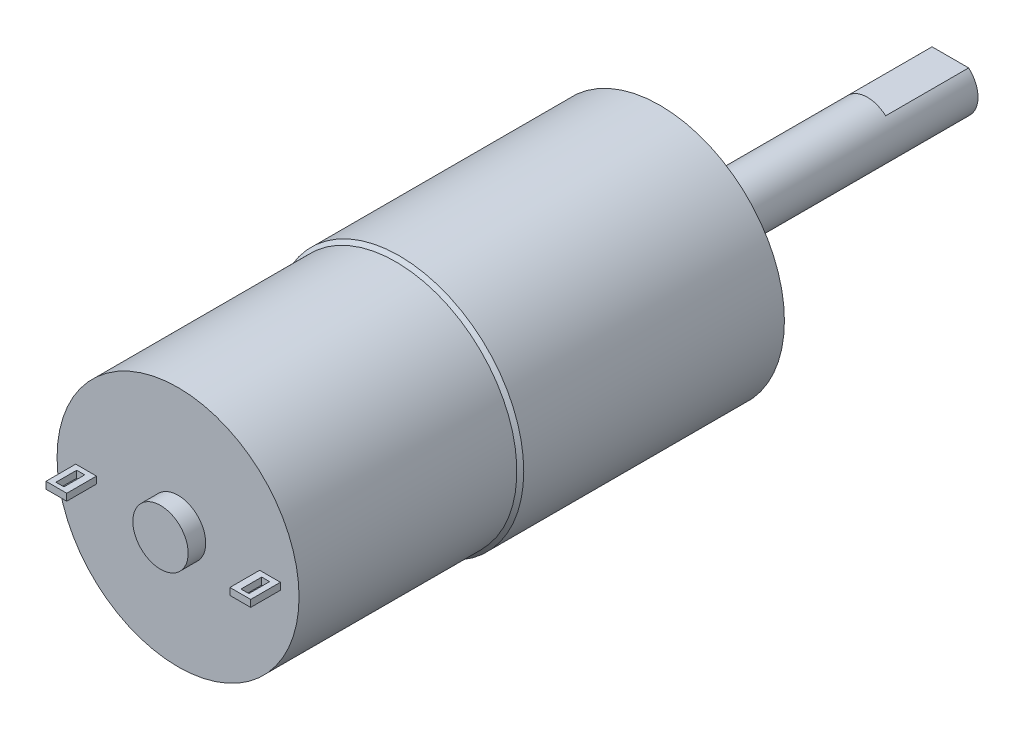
ISO-10303-21;
HEADER;
FILE_DESCRIPTION(('STEP AP214'),'2;1');
FILE_NAME('part.step','',(''),(''),'','','');
FILE_SCHEMA(('AUTOMOTIVE_DESIGN { 1 0 10303 214 1 1 1 1 }'));
ENDSEC;
DATA;
#1=APPLICATION_CONTEXT('core data for automotive mechanical design processes');
#2=APPLICATION_PROTOCOL_DEFINITION('international standard','automotive_design',2000,#1);
#3=PRODUCT_CONTEXT('',#1,'mechanical');
#4=PRODUCT('Part','Part','',(#3));
#5=PRODUCT_RELATED_PRODUCT_CATEGORY('part','',(#4));
#6=PRODUCT_DEFINITION_FORMATION('','',#4);
#7=PRODUCT_DEFINITION_CONTEXT('part definition',#1,'design');
#8=PRODUCT_DEFINITION('design','',#6,#7);
#9=PRODUCT_DEFINITION_SHAPE('','',#8);
#10=(LENGTH_UNIT() NAMED_UNIT(*) SI_UNIT(.MILLI.,.METRE.));
#11=(NAMED_UNIT(*) PLANE_ANGLE_UNIT() SI_UNIT($,.RADIAN.));
#12=(NAMED_UNIT(*) SI_UNIT($,.STERADIAN.) SOLID_ANGLE_UNIT());
#13=UNCERTAINTY_MEASURE_WITH_UNIT(LENGTH_MEASURE(1.E-05),#10,'distance_accuracy_value','');
#14=(GEOMETRIC_REPRESENTATION_CONTEXT(3) GLOBAL_UNCERTAINTY_ASSIGNED_CONTEXT((#13)) GLOBAL_UNIT_ASSIGNED_CONTEXT((#10,
#11,#12)) REPRESENTATION_CONTEXT('',''));
#15=CARTESIAN_POINT('',(0.,0.,0.));
#16=DIRECTION('',(0.,0.,1.));
#17=DIRECTION('',(1.,0.,0.));
#18=AXIS2_PLACEMENT_3D('',#15,#16,#17);
#19=CARTESIAN_POINT('',(0.,0.,69.7));
#20=DIRECTION('',(0.,0.,1.));
#21=DIRECTION('',(1.,0.,0.));
#22=AXIS2_PLACEMENT_3D('',#19,#20,#21);
#23=PLANE('',#22);
#24=CARTESIAN_POINT('',(0.,0.,69.7));
#25=DIRECTION('',(0.,0.,1.));
#26=DIRECTION('',(1.,0.,0.));
#27=AXIS2_PLACEMENT_3D('',#24,#25,#26);
#28=CIRCLE('',#27,4.);
#29=CARTESIAN_POINT('',(4.,0.,69.7));
#30=VERTEX_POINT('',#29);
#31=EDGE_CURVE('E11',#30,#30,#28,.T.);
#32=ORIENTED_EDGE('',*,*,#31,.F.);
#33=EDGE_LOOP('',(#32));
#34=FACE_BOUND('',#33,.T.);
#35=CARTESIAN_POINT('',(0.,0.,69.7));
#36=DIRECTION('',(0.,0.,1.));
#37=DIRECTION('',(1.,0.,0.));
#38=AXIS2_PLACEMENT_3D('',#35,#36,#37);
#39=CIRCLE('',#38,17.5);
#40=CARTESIAN_POINT('',(17.5,0.,69.7));
#41=VERTEX_POINT('',#40);
#42=EDGE_CURVE('E405',#41,#41,#39,.T.);
#43=ORIENTED_EDGE('',*,*,#42,.T.);
#44=EDGE_LOOP('',(#43));
#45=FACE_BOUND('',#44,.T.);
#46=DIRECTION('',(1.,0.,0.));
#47=VECTOR('',#46,1.);
#48=CARTESIAN_POINT('',(-14.8,-0.499999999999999,69.7));
#49=LINE('',#48,#47);
#50=CARTESIAN_POINT('',(-14.8,-0.499999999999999,69.7));
#51=VERTEX_POINT('',#50);
#52=CARTESIAN_POINT('',(-11.8,-0.499999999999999,69.7));
#53=VERTEX_POINT('',#52);
#54=EDGE_CURVE('E353',#51,#53,#49,.T.);
#55=ORIENTED_EDGE('',*,*,#54,.F.);
#56=DIRECTION('',(0.,-1.,0.));
#57=VECTOR('',#56,1.);
#58=CARTESIAN_POINT('',(-14.8,0.500000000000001,69.7));
#59=LINE('',#58,#57);
#60=CARTESIAN_POINT('',(-14.8,0.500000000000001,69.7));
#61=VERTEX_POINT('',#60);
#62=EDGE_CURVE('E305',#61,#51,#59,.T.);
#63=ORIENTED_EDGE('',*,*,#62,.F.);
#64=DIRECTION('',(1.,0.,0.));
#65=VECTOR('',#64,1.);
#66=CARTESIAN_POINT('',(-14.8,0.500000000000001,69.7));
#67=LINE('',#66,#65);
#68=CARTESIAN_POINT('',(-11.8,0.500000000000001,69.7));
#69=VERTEX_POINT('',#68);
#70=EDGE_CURVE('E346',#61,#69,#67,.T.);
#71=ORIENTED_EDGE('',*,*,#70,.T.);
#72=DIRECTION('',(0.,-1.,0.));
#73=VECTOR('',#72,1.);
#74=CARTESIAN_POINT('',(-11.8,0.500000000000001,69.7));
#75=LINE('',#74,#73);
#76=EDGE_CURVE('E349',#69,#53,#75,.T.);
#77=ORIENTED_EDGE('',*,*,#76,.T.);
#78=EDGE_LOOP('',(#55,#63,#71,#77));
#79=FACE_BOUND('',#78,.T.);
#80=DIRECTION('',(1.,0.,0.));
#81=VECTOR('',#80,1.);
#82=CARTESIAN_POINT('',(11.8,-0.5,69.7));
#83=LINE('',#82,#81);
#84=CARTESIAN_POINT('',(11.8,-0.5,69.7));
#85=VERTEX_POINT('',#84);
#86=CARTESIAN_POINT('',(14.8,-0.5,69.7));
#87=VERTEX_POINT('',#86);
#88=EDGE_CURVE('E304',#85,#87,#83,.T.);
#89=ORIENTED_EDGE('',*,*,#88,.F.);
#90=DIRECTION('',(0.,-1.,0.));
#91=VECTOR('',#90,1.);
#92=CARTESIAN_POINT('',(11.8,0.5,69.7));
#93=LINE('',#92,#91);
#94=CARTESIAN_POINT('',(11.8,0.5,69.7));
#95=VERTEX_POINT('',#94);
#96=EDGE_CURVE('E300',#95,#85,#93,.T.);
#97=ORIENTED_EDGE('',*,*,#96,.F.);
#98=DIRECTION('',(1.,0.,0.));
#99=VECTOR('',#98,1.);
#100=CARTESIAN_POINT('',(11.8,0.5,69.7));
#101=LINE('',#100,#99);
#102=CARTESIAN_POINT('',(14.8,0.5,69.7));
#103=VERTEX_POINT('',#102);
#104=EDGE_CURVE('E288',#95,#103,#101,.T.);
#105=ORIENTED_EDGE('',*,*,#104,.T.);
#106=DIRECTION('',(0.,-1.,0.));
#107=VECTOR('',#106,1.);
#108=CARTESIAN_POINT('',(14.8,0.5,69.7));
#109=LINE('',#108,#107);
#110=EDGE_CURVE('E309',#103,#87,#109,.T.);
#111=ORIENTED_EDGE('',*,*,#110,.T.);
#112=EDGE_LOOP('',(#89,#97,#105,#111));
#113=FACE_BOUND('',#112,.T.);
#114=ADVANCED_FACE('F55',(#34,#45,#79,#113),#23,.T.);
#115=CARTESIAN_POINT('',(0.,0.,38.7));
#116=DIRECTION('',(0.,0.,-1.));
#117=DIRECTION('',(-1.,0.,0.));
#118=AXIS2_PLACEMENT_3D('',#115,#116,#117);
#119=CYLINDRICAL_SURFACE('',#118,18.);
#120=CARTESIAN_POINT('',(0.,0.,37.7));
#121=DIRECTION('',(0.,0.,1.));
#122=DIRECTION('',(1.,0.,0.));
#123=AXIS2_PLACEMENT_3D('',#120,#121,#122);
#124=CIRCLE('',#123,18.);
#125=CARTESIAN_POINT('',(18.,0.,37.7));
#126=VERTEX_POINT('',#125);
#127=EDGE_CURVE('E415',#126,#126,#124,.F.);
#128=ORIENTED_EDGE('',*,*,#127,.T.);
#129=EDGE_LOOP('',(#128));
#130=FACE_BOUND('',#129,.T.);
#131=CARTESIAN_POINT('',(0.,0.,0.));
#132=DIRECTION('',(0.,0.,1.));
#133=DIRECTION('',(1.,0.,0.));
#134=AXIS2_PLACEMENT_3D('',#131,#132,#133);
#135=CIRCLE('',#134,18.);
#136=CARTESIAN_POINT('',(18.,0.,0.));
#137=VERTEX_POINT('',#136);
#138=EDGE_CURVE('E412',#137,#137,#135,.T.);
#139=ORIENTED_EDGE('',*,*,#138,.T.);
#140=EDGE_LOOP('',(#139));
#141=FACE_BOUND('',#140,.T.);
#142=ADVANCED_FACE('F443',(#130,#141),#119,.T.);
#143=CARTESIAN_POINT('',(0.,0.,0.));
#144=DIRECTION('',(0.,0.,1.));
#145=DIRECTION('',(1.,0.,0.));
#146=AXIS2_PLACEMENT_3D('',#143,#144,#145);
#147=PLANE('',#146);
#148=CARTESIAN_POINT('',(0.,0.,0.));
#149=DIRECTION('',(0.,0.,-1.));
#150=DIRECTION('',(-1.,0.,0.));
#151=AXIS2_PLACEMENT_3D('',#148,#149,#150);
#152=CIRCLE('',#151,11.);
#153=CARTESIAN_POINT('',(-11.,0.,0.));
#154=VERTEX_POINT('',#153);
#155=EDGE_CURVE('E401',#154,#154,#152,.T.);
#156=ORIENTED_EDGE('',*,*,#155,.F.);
#157=EDGE_LOOP('',(#156));
#158=FACE_BOUND('',#157,.T.);
#159=ORIENTED_EDGE('',*,*,#138,.F.);
#160=EDGE_LOOP('',(#159));
#161=FACE_BOUND('',#160,.T.);
#162=ADVANCED_FACE('F440',(#158,#161),#147,.F.);
#163=CARTESIAN_POINT('',(0.,0.,69.7));
#164=DIRECTION('',(0.,0.,-1.));
#165=DIRECTION('',(-1.,0.,0.));
#166=AXIS2_PLACEMENT_3D('',#163,#164,#165);
#167=CYLINDRICAL_SURFACE('',#166,17.5);
#168=CARTESIAN_POINT('',(0.,0.,38.2));
#169=DIRECTION('',(0.,0.,-1.));
#170=DIRECTION('',(-1.,0.,0.));
#171=AXIS2_PLACEMENT_3D('',#168,#169,#170);
#172=CIRCLE('',#171,17.5);
#173=CARTESIAN_POINT('',(-17.5,0.,38.2));
#174=VERTEX_POINT('',#173);
#175=EDGE_CURVE('E60',#174,#174,#172,.F.);
#176=ORIENTED_EDGE('',*,*,#175,.T.);
#177=EDGE_LOOP('',(#176));
#178=FACE_BOUND('',#177,.T.);
#179=ORIENTED_EDGE('',*,*,#42,.F.);
#180=EDGE_LOOP('',(#179));
#181=FACE_BOUND('',#180,.T.);
#182=ADVANCED_FACE('F426',(#178,#181),#167,.T.);
#183=CARTESIAN_POINT('',(0.,0.,38.7));
#184=DIRECTION('',(0.,0.,-1.));
#185=DIRECTION('',(-1.,0.,0.));
#186=AXIS2_PLACEMENT_3D('',#183,#184,#185);
#187=CONICAL_SURFACE('',#186,17.,0.785398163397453);
#188=ORIENTED_EDGE('',*,*,#127,.F.);
#189=EDGE_LOOP('',(#188));
#190=FACE_BOUND('',#189,.T.);
#191=ORIENTED_EDGE('',*,*,#175,.F.);
#192=EDGE_LOOP('',(#191));
#193=FACE_BOUND('',#192,.T.);
#194=ADVANCED_FACE('F58',(#190,#193),#187,.T.);
#195=CARTESIAN_POINT('',(0.,0.,-2.));
#196=DIRECTION('',(0.,0.,1.));
#197=DIRECTION('',(1.,0.,0.));
#198=AXIS2_PLACEMENT_3D('',#195,#196,#197);
#199=CYLINDRICAL_SURFACE('',#198,11.);
#200=CARTESIAN_POINT('',(0.,0.,-2.));
#201=DIRECTION('',(0.,0.,-1.));
#202=DIRECTION('',(-1.,0.,0.));
#203=AXIS2_PLACEMENT_3D('',#200,#201,#202);
#204=CIRCLE('',#203,11.);
#205=CARTESIAN_POINT('',(-11.,0.,-2.));
#206=VERTEX_POINT('',#205);
#207=EDGE_CURVE('E397',#206,#206,#204,.T.);
#208=ORIENTED_EDGE('',*,*,#207,.F.);
#209=EDGE_LOOP('',(#208));
#210=FACE_BOUND('',#209,.T.);
#211=ORIENTED_EDGE('',*,*,#155,.T.);
#212=EDGE_LOOP('',(#211));
#213=FACE_BOUND('',#212,.T.);
#214=ADVANCED_FACE('F430',(#210,#213),#199,.T.);
#215=CARTESIAN_POINT('',(0.,0.,-2.));
#216=DIRECTION('',(0.,0.,-1.));
#217=DIRECTION('',(-1.,0.,0.));
#218=AXIS2_PLACEMENT_3D('',#215,#216,#217);
#219=PLANE('',#218);
#220=CARTESIAN_POINT('',(0.,0.,-2.));
#221=DIRECTION('',(0.,0.,-1.));
#222=DIRECTION('',(-1.,0.,0.));
#223=AXIS2_PLACEMENT_3D('',#220,#221,#222);
#224=CIRCLE('',#223,4.);
#225=CARTESIAN_POINT('',(-4.,0.,-2.));
#226=VERTEX_POINT('',#225);
#227=EDGE_CURVE('E66',#226,#226,#224,.T.);
#228=ORIENTED_EDGE('',*,*,#227,.F.);
#229=EDGE_LOOP('',(#228));
#230=FACE_BOUND('',#229,.T.);
#231=ORIENTED_EDGE('',*,*,#207,.T.);
#232=EDGE_LOOP('',(#231));
#233=FACE_BOUND('',#232,.T.);
#234=ADVANCED_FACE('F436',(#230,#233),#219,.T.);
#235=CARTESIAN_POINT('',(0.,0.,-42.));
#236=DIRECTION('',(0.,0.,1.));
#237=DIRECTION('',(1.,0.,0.));
#238=AXIS2_PLACEMENT_3D('',#235,#236,#237);
#239=CYLINDRICAL_SURFACE('',#238,4.);
#240=CARTESIAN_POINT('',(0.,0.,-42.));
#241=DIRECTION('',(0.,0.,-1.));
#242=DIRECTION('',(-1.,0.,0.));
#243=AXIS2_PLACEMENT_3D('',#240,#241,#242);
#244=CIRCLE('',#243,4.);
#245=CARTESIAN_POINT('',(2.64575131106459,3.,-42.));
#246=VERTEX_POINT('',#245);
#247=CARTESIAN_POINT('',(-2.64575131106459,3.,-42.));
#248=VERTEX_POINT('',#247);
#249=EDGE_CURVE('E390',#246,#248,#244,.T.);
#250=ORIENTED_EDGE('',*,*,#249,.F.);
#251=DIRECTION('',(0.,0.,-1.));
#252=VECTOR('',#251,1.);
#253=CARTESIAN_POINT('',(2.64575131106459,3.,-30.));
#254=LINE('',#253,#252);
#255=CARTESIAN_POINT('',(2.64575131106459,3.,-30.));
#256=VERTEX_POINT('',#255);
#257=EDGE_CURVE('E388',#256,#246,#254,.T.);
#258=ORIENTED_EDGE('',*,*,#257,.F.);
#259=CARTESIAN_POINT('',(0.,0.,-30.));
#260=DIRECTION('',(0.,0.,-1.));
#261=DIRECTION('',(-1.,0.,0.));
#262=AXIS2_PLACEMENT_3D('',#259,#260,#261);
#263=CIRCLE('',#262,4.);
#264=CARTESIAN_POINT('',(-2.64575131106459,3.,-30.));
#265=VERTEX_POINT('',#264);
#266=EDGE_CURVE('E381',#265,#256,#263,.T.);
#267=ORIENTED_EDGE('',*,*,#266,.F.);
#268=DIRECTION('',(0.,0.,-1.));
#269=VECTOR('',#268,1.);
#270=CARTESIAN_POINT('',(-2.64575131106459,3.,-30.));
#271=LINE('',#270,#269);
#272=EDGE_CURVE('E385',#265,#248,#271,.T.);
#273=ORIENTED_EDGE('',*,*,#272,.T.);
#274=EDGE_LOOP('',(#250,#258,#267,#273));
#275=FACE_BOUND('',#274,.T.);
#276=ORIENTED_EDGE('',*,*,#227,.T.);
#277=EDGE_LOOP('',(#276));
#278=FACE_BOUND('',#277,.T.);
#279=ADVANCED_FACE('F476',(#275,#278),#239,.T.);
#280=CARTESIAN_POINT('',(0.,0.,-42.));
#281=DIRECTION('',(0.,0.,-1.));
#282=DIRECTION('',(-1.,0.,0.));
#283=AXIS2_PLACEMENT_3D('',#280,#281,#282);
#284=PLANE('',#283);
#285=DIRECTION('',(-1.,0.,0.));
#286=VECTOR('',#285,1.);
#287=CARTESIAN_POINT('',(2.64575131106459,3.,-42.));
#288=LINE('',#287,#286);
#289=EDGE_CURVE('E375',#246,#248,#288,.T.);
#290=ORIENTED_EDGE('',*,*,#289,.F.);
#291=ORIENTED_EDGE('',*,*,#249,.T.);
#292=EDGE_LOOP('',(#290,#291));
#293=FACE_BOUND('',#292,.T.);
#294=ADVANCED_FACE('F483',(#293),#284,.T.);
#295=CARTESIAN_POINT('',(2.64575131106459,3.,-30.));
#296=DIRECTION('',(0.,-1.,0.));
#297=DIRECTION('',(0.,0.,-1.));
#298=AXIS2_PLACEMENT_3D('',#295,#296,#297);
#299=PLANE('',#298);
#300=ORIENTED_EDGE('',*,*,#289,.T.);
#301=ORIENTED_EDGE('',*,*,#272,.F.);
#302=DIRECTION('',(-1.,0.,0.));
#303=VECTOR('',#302,1.);
#304=CARTESIAN_POINT('',(2.64575131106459,3.,-30.));
#305=LINE('',#304,#303);
#306=EDGE_CURVE('E377',#256,#265,#305,.T.);
#307=ORIENTED_EDGE('',*,*,#306,.F.);
#308=ORIENTED_EDGE('',*,*,#257,.T.);
#309=EDGE_LOOP('',(#300,#301,#307,#308));
#310=FACE_BOUND('',#309,.T.);
#311=ADVANCED_FACE('F491',(#310),#299,.F.);
#312=CARTESIAN_POINT('',(0.,0.,-30.));
#313=DIRECTION('',(0.,0.,-1.));
#314=DIRECTION('',(-1.,0.,0.));
#315=AXIS2_PLACEMENT_3D('',#312,#313,#314);
#316=PLANE('',#315);
#317=ORIENTED_EDGE('',*,*,#306,.T.);
#318=ORIENTED_EDGE('',*,*,#266,.T.);
#319=EDGE_LOOP('',(#317,#318));
#320=FACE_BOUND('',#319,.T.);
#321=ADVANCED_FACE('F752',(#320),#316,.T.);
#322=CARTESIAN_POINT('',(0.,0.,72.24));
#323=DIRECTION('',(0.,0.,-1.));
#324=DIRECTION('',(-1.,0.,0.));
#325=AXIS2_PLACEMENT_3D('',#322,#323,#324);
#326=CYLINDRICAL_SURFACE('',#325,4.);
#327=CARTESIAN_POINT('',(0.,0.,72.24));
#328=DIRECTION('',(0.,0.,1.));
#329=DIRECTION('',(1.,0.,0.));
#330=AXIS2_PLACEMENT_3D('',#327,#328,#329);
#331=CIRCLE('',#330,4.);
#332=CARTESIAN_POINT('',(4.,0.,72.24));
#333=VERTEX_POINT('',#332);
#334=EDGE_CURVE('E329',#333,#333,#331,.T.);
#335=ORIENTED_EDGE('',*,*,#334,.F.);
#336=EDGE_LOOP('',(#335));
#337=FACE_BOUND('',#336,.T.);
#338=ORIENTED_EDGE('',*,*,#31,.T.);
#339=EDGE_LOOP('',(#338));
#340=FACE_BOUND('',#339,.T.);
#341=ADVANCED_FACE('F741',(#337,#340),#326,.T.);
#342=CARTESIAN_POINT('',(0.,0.,72.24));
#343=DIRECTION('',(0.,0.,1.));
#344=DIRECTION('',(1.,0.,0.));
#345=AXIS2_PLACEMENT_3D('',#342,#343,#344);
#346=PLANE('',#345);
#347=ORIENTED_EDGE('',*,*,#334,.T.);
#348=EDGE_LOOP('',(#347));
#349=FACE_BOUND('',#348,.T.);
#350=ADVANCED_FACE('F501',(#349),#346,.T.);
#351=CARTESIAN_POINT('',(-14.8,0.500000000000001,74.));
#352=DIRECTION('',(1.,0.,0.));
#353=DIRECTION('',(0.,0.,-1.));
#354=AXIS2_PLACEMENT_3D('',#351,#352,#353);
#355=PLANE('',#354);
#356=ORIENTED_EDGE('',*,*,#62,.T.);
#357=DIRECTION('',(0.,0.,-1.));
#358=VECTOR('',#357,1.);
#359=CARTESIAN_POINT('',(-14.8,-0.499999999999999,74.));
#360=LINE('',#359,#358);
#361=CARTESIAN_POINT('',(-14.8,-0.499999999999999,74.));
#362=VERTEX_POINT('',#361);
#363=EDGE_CURVE('E282',#362,#51,#360,.T.);
#364=ORIENTED_EDGE('',*,*,#363,.F.);
#365=DIRECTION('',(0.,-1.,0.));
#366=VECTOR('',#365,1.);
#367=CARTESIAN_POINT('',(-14.8,0.500000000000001,74.));
#368=LINE('',#367,#366);
#369=CARTESIAN_POINT('',(-14.8,0.500000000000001,74.));
#370=VERTEX_POINT('',#369);
#371=EDGE_CURVE('E350',#370,#362,#368,.T.);
#372=ORIENTED_EDGE('',*,*,#371,.F.);
#373=DIRECTION('',(0.,0.,-1.));
#374=VECTOR('',#373,1.);
#375=CARTESIAN_POINT('',(-14.8,0.500000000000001,74.));
#376=LINE('',#375,#374);
#377=EDGE_CURVE('E341',#370,#61,#376,.T.);
#378=ORIENTED_EDGE('',*,*,#377,.T.);
#379=EDGE_LOOP('',(#356,#364,#372,#378));
#380=FACE_BOUND('',#379,.T.);
#381=ADVANCED_FACE('F497',(#380),#355,.F.);
#382=CARTESIAN_POINT('',(-14.8,-0.499999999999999,74.));
#383=DIRECTION('',(0.,1.,0.));
#384=DIRECTION('',(0.,0.,1.));
#385=AXIS2_PLACEMENT_3D('',#382,#383,#384);
#386=PLANE('',#385);
#387=DIRECTION('',(1.,0.,0.));
#388=VECTOR('',#387,1.);
#389=CARTESIAN_POINT('',(-14.8,-0.499999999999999,73.4));
#390=LINE('',#389,#388);
#391=CARTESIAN_POINT('',(-13.9628480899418,-0.5,73.4));
#392=VERTEX_POINT('',#391);
#393=CARTESIAN_POINT('',(-12.8,-0.5,73.4));
#394=VERTEX_POINT('',#393);
#395=EDGE_CURVE('E274',#392,#394,#390,.T.);
#396=ORIENTED_EDGE('',*,*,#395,.T.);
#397=DIRECTION('',(0.,0.,-1.));
#398=VECTOR('',#397,1.);
#399=CARTESIAN_POINT('',(-12.8,-0.499999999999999,74.));
#400=LINE('',#399,#398);
#401=CARTESIAN_POINT('',(-12.8,-0.5,70.4));
#402=VERTEX_POINT('',#401);
#403=EDGE_CURVE('E278',#394,#402,#400,.T.);
#404=ORIENTED_EDGE('',*,*,#403,.T.);
#405=DIRECTION('',(-1.,0.,0.));
#406=VECTOR('',#405,1.);
#407=CARTESIAN_POINT('',(-14.8,-0.499999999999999,70.4));
#408=LINE('',#407,#406);
#409=CARTESIAN_POINT('',(-13.9628480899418,-0.499999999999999,70.4));
#410=VERTEX_POINT('',#409);
#411=EDGE_CURVE('E266',#402,#410,#408,.T.);
#412=ORIENTED_EDGE('',*,*,#411,.T.);
#413=DIRECTION('',(0.,0.,1.));
#414=VECTOR('',#413,1.);
#415=CARTESIAN_POINT('',(-13.9628480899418,-0.499999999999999,74.));
#416=LINE('',#415,#414);
#417=EDGE_CURVE('E270',#410,#392,#416,.T.);
#418=ORIENTED_EDGE('',*,*,#417,.T.);
#419=EDGE_LOOP('',(#396,#404,#412,#418));
#420=FACE_BOUND('',#419,.T.);
#421=ORIENTED_EDGE('',*,*,#54,.T.);
#422=DIRECTION('',(0.,0.,-1.));
#423=VECTOR('',#422,1.);
#424=CARTESIAN_POINT('',(-11.8,-0.499999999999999,74.));
#425=LINE('',#424,#423);
#426=CARTESIAN_POINT('',(-11.8,-0.499999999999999,74.));
#427=VERTEX_POINT('',#426);
#428=EDGE_CURVE('E333',#427,#53,#425,.T.);
#429=ORIENTED_EDGE('',*,*,#428,.F.);
#430=DIRECTION('',(1.,0.,0.));
#431=VECTOR('',#430,1.);
#432=CARTESIAN_POINT('',(-14.8,-0.499999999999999,74.));
#433=LINE('',#432,#431);
#434=EDGE_CURVE('E367',#362,#427,#433,.T.);
#435=ORIENTED_EDGE('',*,*,#434,.F.);
#436=ORIENTED_EDGE('',*,*,#363,.T.);
#437=EDGE_LOOP('',(#421,#429,#435,#436));
#438=FACE_BOUND('',#437,.T.);
#439=ADVANCED_FACE('F500',(#420,#438),#386,.F.);
#440=CARTESIAN_POINT('',(-11.8,0.500000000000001,74.));
#441=DIRECTION('',(1.,0.,0.));
#442=DIRECTION('',(0.,0.,-1.));
#443=AXIS2_PLACEMENT_3D('',#440,#441,#442);
#444=PLANE('',#443);
#445=ORIENTED_EDGE('',*,*,#76,.F.);
#446=DIRECTION('',(0.,0.,-1.));
#447=VECTOR('',#446,1.);
#448=CARTESIAN_POINT('',(-11.8,0.500000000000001,74.));
#449=LINE('',#448,#447);
#450=CARTESIAN_POINT('',(-11.8,0.500000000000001,74.));
#451=VERTEX_POINT('',#450);
#452=EDGE_CURVE('E337',#451,#69,#449,.T.);
#453=ORIENTED_EDGE('',*,*,#452,.F.);
#454=DIRECTION('',(0.,-1.,0.));
#455=VECTOR('',#454,1.);
#456=CARTESIAN_POINT('',(-11.8,0.500000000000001,74.));
#457=LINE('',#456,#455);
#458=EDGE_CURVE('E363',#451,#427,#457,.T.);
#459=ORIENTED_EDGE('',*,*,#458,.T.);
#460=ORIENTED_EDGE('',*,*,#428,.T.);
#461=EDGE_LOOP('',(#445,#453,#459,#460));
#462=FACE_BOUND('',#461,.T.);
#463=ADVANCED_FACE('F509',(#462),#444,.T.);
#464=CARTESIAN_POINT('',(-14.8,0.500000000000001,74.));
#465=DIRECTION('',(0.,1.,0.));
#466=DIRECTION('',(0.,0.,1.));
#467=AXIS2_PLACEMENT_3D('',#464,#465,#466);
#468=PLANE('',#467);
#469=DIRECTION('',(0.,0.,-1.));
#470=VECTOR('',#469,1.);
#471=CARTESIAN_POINT('',(-12.8,0.5,70.4));
#472=LINE('',#471,#470);
#473=CARTESIAN_POINT('',(-12.8,0.5,73.4));
#474=VERTEX_POINT('',#473);
#475=CARTESIAN_POINT('',(-12.8,0.500000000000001,70.4));
#476=VERTEX_POINT('',#475);
#477=EDGE_CURVE('E82',#474,#476,#472,.T.);
#478=ORIENTED_EDGE('',*,*,#477,.F.);
#479=DIRECTION('',(1.,0.,0.));
#480=VECTOR('',#479,1.);
#481=CARTESIAN_POINT('',(-13.9628480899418,0.5,73.4));
#482=LINE('',#481,#480);
#483=CARTESIAN_POINT('',(-13.9628480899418,0.5,73.4));
#484=VERTEX_POINT('',#483);
#485=EDGE_CURVE('E234',#484,#474,#482,.T.);
#486=ORIENTED_EDGE('',*,*,#485,.F.);
#487=DIRECTION('',(0.,0.,1.));
#488=VECTOR('',#487,1.);
#489=CARTESIAN_POINT('',(-13.9628480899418,0.5,70.4));
#490=LINE('',#489,#488);
#491=CARTESIAN_POINT('',(-13.9628480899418,0.5,70.4));
#492=VERTEX_POINT('',#491);
#493=EDGE_CURVE('E245',#492,#484,#490,.T.);
#494=ORIENTED_EDGE('',*,*,#493,.F.);
#495=DIRECTION('',(-1.,0.,0.));
#496=VECTOR('',#495,1.);
#497=CARTESIAN_POINT('',(-13.9628480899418,0.5,70.4));
#498=LINE('',#497,#496);
#499=EDGE_CURVE('E249',#476,#492,#498,.T.);
#500=ORIENTED_EDGE('',*,*,#499,.F.);
#501=EDGE_LOOP('',(#478,#486,#494,#500));
#502=FACE_BOUND('',#501,.T.);
#503=ORIENTED_EDGE('',*,*,#70,.F.);
#504=ORIENTED_EDGE('',*,*,#377,.F.);
#505=DIRECTION('',(1.,0.,0.));
#506=VECTOR('',#505,1.);
#507=CARTESIAN_POINT('',(-14.8,0.500000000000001,74.));
#508=LINE('',#507,#506);
#509=EDGE_CURVE('E345',#370,#451,#508,.T.);
#510=ORIENTED_EDGE('',*,*,#509,.T.);
#511=ORIENTED_EDGE('',*,*,#452,.T.);
#512=EDGE_LOOP('',(#503,#504,#510,#511));
#513=FACE_BOUND('',#512,.T.);
#514=ADVANCED_FACE('F517',(#502,#513),#468,.T.);
#515=CARTESIAN_POINT('',(0.,0.,74.));
#516=DIRECTION('',(0.,0.,1.));
#517=DIRECTION('',(1.,0.,0.));
#518=AXIS2_PLACEMENT_3D('',#515,#516,#517);
#519=PLANE('',#518);
#520=ORIENTED_EDGE('',*,*,#371,.T.);
#521=ORIENTED_EDGE('',*,*,#434,.T.);
#522=ORIENTED_EDGE('',*,*,#458,.F.);
#523=ORIENTED_EDGE('',*,*,#509,.F.);
#524=EDGE_LOOP('',(#520,#521,#522,#523));
#525=FACE_BOUND('',#524,.T.);
#526=ADVANCED_FACE('F525',(#525),#519,.T.);
#527=CARTESIAN_POINT('',(11.8,0.5,74.));
#528=DIRECTION('',(1.,0.,0.));
#529=DIRECTION('',(0.,0.,-1.));
#530=AXIS2_PLACEMENT_3D('',#527,#528,#529);
#531=PLANE('',#530);
#532=ORIENTED_EDGE('',*,*,#96,.T.);
#533=DIRECTION('',(0.,0.,-1.));
#534=VECTOR('',#533,1.);
#535=CARTESIAN_POINT('',(11.8,-0.5,74.));
#536=LINE('',#535,#534);
#537=CARTESIAN_POINT('',(11.8,-0.5,74.));
#538=VERTEX_POINT('',#537);
#539=EDGE_CURVE('E325',#538,#85,#536,.T.);
#540=ORIENTED_EDGE('',*,*,#539,.F.);
#541=DIRECTION('',(0.,-1.,0.));
#542=VECTOR('',#541,1.);
#543=CARTESIAN_POINT('',(11.8,0.5,74.));
#544=LINE('',#543,#542);
#545=CARTESIAN_POINT('',(11.8,0.5,74.));
#546=VERTEX_POINT('',#545);
#547=EDGE_CURVE('E283',#546,#538,#544,.T.);
#548=ORIENTED_EDGE('',*,*,#547,.F.);
#549=DIRECTION('',(0.,0.,-1.));
#550=VECTOR('',#549,1.);
#551=CARTESIAN_POINT('',(11.8,0.5,74.));
#552=LINE('',#551,#550);
#553=EDGE_CURVE('E299',#546,#95,#552,.T.);
#554=ORIENTED_EDGE('',*,*,#553,.T.);
#555=EDGE_LOOP('',(#532,#540,#548,#554));
#556=FACE_BOUND('',#555,.T.);
#557=ADVANCED_FACE('F533',(#556),#531,.F.);
#558=CARTESIAN_POINT('',(11.8,-0.5,74.));
#559=DIRECTION('',(0.,1.,0.));
#560=DIRECTION('',(-1.,0.,0.));
#561=AXIS2_PLACEMENT_3D('',#558,#559,#560);
#562=PLANE('',#561);
#563=DIRECTION('',(1.,0.,0.));
#564=VECTOR('',#563,1.);
#565=CARTESIAN_POINT('',(11.8,-0.5,73.4));
#566=LINE('',#565,#564);
#567=CARTESIAN_POINT('',(12.8,-0.500000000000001,73.4));
#568=VERTEX_POINT('',#567);
#569=CARTESIAN_POINT('',(13.9428776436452,-0.500000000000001,73.4));
#570=VERTEX_POINT('',#569);
#571=EDGE_CURVE('E258',#568,#570,#566,.T.);
#572=ORIENTED_EDGE('',*,*,#571,.T.);
#573=DIRECTION('',(0.,0.,-1.));
#574=VECTOR('',#573,1.);
#575=CARTESIAN_POINT('',(13.9428776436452,-0.5,74.));
#576=LINE('',#575,#574);
#577=CARTESIAN_POINT('',(13.9428776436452,-0.500000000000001,70.4));
#578=VERTEX_POINT('',#577);
#579=EDGE_CURVE('E262',#570,#578,#576,.T.);
#580=ORIENTED_EDGE('',*,*,#579,.T.);
#581=DIRECTION('',(-1.,0.,0.));
#582=VECTOR('',#581,1.);
#583=CARTESIAN_POINT('',(11.8,-0.5,70.4));
#584=LINE('',#583,#582);
#585=CARTESIAN_POINT('',(12.8,-0.5,70.4));
#586=VERTEX_POINT('',#585);
#587=EDGE_CURVE('E226',#578,#586,#584,.T.);
#588=ORIENTED_EDGE('',*,*,#587,.T.);
#589=DIRECTION('',(0.,0.,1.));
#590=VECTOR('',#589,1.);
#591=CARTESIAN_POINT('',(12.8,-0.5,74.));
#592=LINE('',#591,#590);
#593=EDGE_CURVE('E193',#586,#568,#592,.T.);
#594=ORIENTED_EDGE('',*,*,#593,.T.);
#595=EDGE_LOOP('',(#572,#580,#588,#594));
#596=FACE_BOUND('',#595,.T.);
#597=ORIENTED_EDGE('',*,*,#88,.T.);
#598=DIRECTION('',(0.,0.,-1.));
#599=VECTOR('',#598,1.);
#600=CARTESIAN_POINT('',(14.8,-0.5,74.));
#601=LINE('',#600,#599);
#602=CARTESIAN_POINT('',(14.8,-0.5,74.));
#603=VERTEX_POINT('',#602);
#604=EDGE_CURVE('E321',#603,#87,#601,.T.);
#605=ORIENTED_EDGE('',*,*,#604,.F.);
#606=DIRECTION('',(1.,0.,0.));
#607=VECTOR('',#606,1.);
#608=CARTESIAN_POINT('',(11.8,-0.5,74.));
#609=LINE('',#608,#607);
#610=EDGE_CURVE('E287',#538,#603,#609,.T.);
#611=ORIENTED_EDGE('',*,*,#610,.F.);
#612=ORIENTED_EDGE('',*,*,#539,.T.);
#613=EDGE_LOOP('',(#597,#605,#611,#612));
#614=FACE_BOUND('',#613,.T.);
#615=ADVANCED_FACE('F541',(#596,#614),#562,.F.);
#616=CARTESIAN_POINT('',(14.8,0.5,74.));
#617=DIRECTION('',(1.,0.,0.));
#618=DIRECTION('',(0.,0.,-1.));
#619=AXIS2_PLACEMENT_3D('',#616,#617,#618);
#620=PLANE('',#619);
#621=ORIENTED_EDGE('',*,*,#110,.F.);
#622=DIRECTION('',(0.,0.,-1.));
#623=VECTOR('',#622,1.);
#624=CARTESIAN_POINT('',(14.8,0.5,74.));
#625=LINE('',#624,#623);
#626=CARTESIAN_POINT('',(14.8,0.5,74.));
#627=VERTEX_POINT('',#626);
#628=EDGE_CURVE('E317',#627,#103,#625,.T.);
#629=ORIENTED_EDGE('',*,*,#628,.F.);
#630=DIRECTION('',(0.,-1.,0.));
#631=VECTOR('',#630,1.);
#632=CARTESIAN_POINT('',(14.8,0.5,74.));
#633=LINE('',#632,#631);
#634=EDGE_CURVE('E291',#627,#603,#633,.T.);
#635=ORIENTED_EDGE('',*,*,#634,.T.);
#636=ORIENTED_EDGE('',*,*,#604,.T.);
#637=EDGE_LOOP('',(#621,#629,#635,#636));
#638=FACE_BOUND('',#637,.T.);
#639=ADVANCED_FACE('F549',(#638),#620,.T.);
#640=CARTESIAN_POINT('',(11.8,0.5,74.));
#641=DIRECTION('',(0.,1.,0.));
#642=DIRECTION('',(0.,0.,1.));
#643=AXIS2_PLACEMENT_3D('',#640,#641,#642);
#644=PLANE('',#643);
#645=DIRECTION('',(0.,0.,-1.));
#646=VECTOR('',#645,1.);
#647=CARTESIAN_POINT('',(13.9428776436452,0.5,73.4));
#648=LINE('',#647,#646);
#649=CARTESIAN_POINT('',(13.9428776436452,0.5,73.4));
#650=VERTEX_POINT('',#649);
#651=CARTESIAN_POINT('',(13.9428776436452,0.5,70.4));
#652=VERTEX_POINT('',#651);
#653=EDGE_CURVE('E208',#650,#652,#648,.T.);
#654=ORIENTED_EDGE('',*,*,#653,.F.);
#655=DIRECTION('',(1.,0.,0.));
#656=VECTOR('',#655,1.);
#657=CARTESIAN_POINT('',(12.8,0.5,73.4));
#658=LINE('',#657,#656);
#659=CARTESIAN_POINT('',(12.8,0.5,73.4));
#660=VERTEX_POINT('',#659);
#661=EDGE_CURVE('E213',#660,#650,#658,.T.);
#662=ORIENTED_EDGE('',*,*,#661,.F.);
#663=DIRECTION('',(0.,0.,1.));
#664=VECTOR('',#663,1.);
#665=CARTESIAN_POINT('',(12.8,0.5,73.4));
#666=LINE('',#665,#664);
#667=CARTESIAN_POINT('',(12.8,0.5,70.4));
#668=VERTEX_POINT('',#667);
#669=EDGE_CURVE('E190',#668,#660,#666,.T.);
#670=ORIENTED_EDGE('',*,*,#669,.F.);
#671=DIRECTION('',(-1.,0.,0.));
#672=VECTOR('',#671,1.);
#673=CARTESIAN_POINT('',(12.8,0.5,70.4));
#674=LINE('',#673,#672);
#675=EDGE_CURVE('E202',#652,#668,#674,.T.);
#676=ORIENTED_EDGE('',*,*,#675,.F.);
#677=EDGE_LOOP('',(#654,#662,#670,#676));
#678=FACE_BOUND('',#677,.T.);
#679=ORIENTED_EDGE('',*,*,#104,.F.);
#680=ORIENTED_EDGE('',*,*,#553,.F.);
#681=DIRECTION('',(1.,0.,0.));
#682=VECTOR('',#681,1.);
#683=CARTESIAN_POINT('',(11.8,0.5,74.));
#684=LINE('',#683,#682);
#685=EDGE_CURVE('E295',#546,#627,#684,.T.);
#686=ORIENTED_EDGE('',*,*,#685,.T.);
#687=ORIENTED_EDGE('',*,*,#628,.T.);
#688=EDGE_LOOP('',(#679,#680,#686,#687));
#689=FACE_BOUND('',#688,.T.);
#690=ADVANCED_FACE('F210',(#678,#689),#644,.T.);
#691=CARTESIAN_POINT('',(0.,0.,74.));
#692=DIRECTION('',(0.,0.,1.));
#693=DIRECTION('',(1.,0.,0.));
#694=AXIS2_PLACEMENT_3D('',#691,#692,#693);
#695=PLANE('',#694);
#696=ORIENTED_EDGE('',*,*,#547,.T.);
#697=ORIENTED_EDGE('',*,*,#610,.T.);
#698=ORIENTED_EDGE('',*,*,#634,.F.);
#699=ORIENTED_EDGE('',*,*,#685,.F.);
#700=EDGE_LOOP('',(#696,#697,#698,#699));
#701=FACE_BOUND('',#700,.T.);
#702=ADVANCED_FACE('F564',(#701),#695,.T.);
#703=CARTESIAN_POINT('',(13.9428776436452,-3.8,73.4));
#704=DIRECTION('',(1.,0.,0.));
#705=DIRECTION('',(0.,0.,-1.));
#706=AXIS2_PLACEMENT_3D('',#703,#704,#705);
#707=PLANE('',#706);
#708=DIRECTION('',(0.,1.,0.));
#709=VECTOR('',#708,1.);
#710=CARTESIAN_POINT('',(13.9428776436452,-3.8,73.4));
#711=LINE('',#710,#709);
#712=EDGE_CURVE('E223',#570,#650,#711,.T.);
#713=ORIENTED_EDGE('',*,*,#712,.T.);
#714=ORIENTED_EDGE('',*,*,#653,.T.);
#715=DIRECTION('',(0.,1.,0.));
#716=VECTOR('',#715,1.);
#717=CARTESIAN_POINT('',(13.9428776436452,-3.8,70.4));
#718=LINE('',#717,#716);
#719=EDGE_CURVE('E198',#578,#652,#718,.T.);
#720=ORIENTED_EDGE('',*,*,#719,.F.);
#721=ORIENTED_EDGE('',*,*,#579,.F.);
#722=EDGE_LOOP('',(#713,#714,#720,#721));
#723=FACE_BOUND('',#722,.T.);
#724=ADVANCED_FACE('F570',(#723),#707,.F.);
#725=CARTESIAN_POINT('',(12.8,-3.8,73.4));
#726=DIRECTION('',(0.,0.,1.));
#727=DIRECTION('',(1.,0.,0.));
#728=AXIS2_PLACEMENT_3D('',#725,#726,#727);
#729=PLANE('',#728);
#730=DIRECTION('',(0.,1.,0.));
#731=VECTOR('',#730,1.);
#732=CARTESIAN_POINT('',(12.8,-3.8,73.4));
#733=LINE('',#732,#731);
#734=EDGE_CURVE('E197',#568,#660,#733,.T.);
#735=ORIENTED_EDGE('',*,*,#734,.T.);
#736=ORIENTED_EDGE('',*,*,#661,.T.);
#737=ORIENTED_EDGE('',*,*,#712,.F.);
#738=ORIENTED_EDGE('',*,*,#571,.F.);
#739=EDGE_LOOP('',(#735,#736,#737,#738));
#740=FACE_BOUND('',#739,.T.);
#741=ADVANCED_FACE('F584',(#740),#729,.F.);
#742=CARTESIAN_POINT('',(12.8,-3.8,73.4));
#743=DIRECTION('',(-1.,0.,0.));
#744=DIRECTION('',(0.,0.,1.));
#745=AXIS2_PLACEMENT_3D('',#742,#743,#744);
#746=PLANE('',#745);
#747=DIRECTION('',(0.,1.,0.));
#748=VECTOR('',#747,1.);
#749=CARTESIAN_POINT('',(12.8,-3.8,70.4));
#750=LINE('',#749,#748);
#751=EDGE_CURVE('E185',#586,#668,#750,.T.);
#752=ORIENTED_EDGE('',*,*,#751,.T.);
#753=ORIENTED_EDGE('',*,*,#669,.T.);
#754=ORIENTED_EDGE('',*,*,#734,.F.);
#755=ORIENTED_EDGE('',*,*,#593,.F.);
#756=EDGE_LOOP('',(#752,#753,#754,#755));
#757=FACE_BOUND('',#756,.T.);
#758=ADVANCED_FACE('F187',(#757),#746,.F.);
#759=CARTESIAN_POINT('',(12.8,-3.8,70.4));
#760=DIRECTION('',(0.,0.,-1.));
#761=DIRECTION('',(-1.,0.,0.));
#762=AXIS2_PLACEMENT_3D('',#759,#760,#761);
#763=PLANE('',#762);
#764=ORIENTED_EDGE('',*,*,#719,.T.);
#765=ORIENTED_EDGE('',*,*,#675,.T.);
#766=ORIENTED_EDGE('',*,*,#751,.F.);
#767=ORIENTED_EDGE('',*,*,#587,.F.);
#768=EDGE_LOOP('',(#764,#765,#766,#767));
#769=FACE_BOUND('',#768,.T.);
#770=ADVANCED_FACE('F203',(#769),#763,.F.);
#771=CARTESIAN_POINT('',(-12.8,-3.8,70.4));
#772=DIRECTION('',(1.,0.,0.));
#773=DIRECTION('',(0.,0.,-1.));
#774=AXIS2_PLACEMENT_3D('',#771,#772,#773);
#775=PLANE('',#774);
#776=DIRECTION('',(0.,1.,0.));
#777=VECTOR('',#776,1.);
#778=CARTESIAN_POINT('',(-12.8,-3.8,73.4));
#779=LINE('',#778,#777);
#780=EDGE_CURVE('E239',#394,#474,#779,.T.);
#781=ORIENTED_EDGE('',*,*,#780,.T.);
#782=ORIENTED_EDGE('',*,*,#477,.T.);
#783=DIRECTION('',(0.,1.,0.));
#784=VECTOR('',#783,1.);
#785=CARTESIAN_POINT('',(-12.8,-3.8,70.4));
#786=LINE('',#785,#784);
#787=EDGE_CURVE('E231',#402,#476,#786,.T.);
#788=ORIENTED_EDGE('',*,*,#787,.F.);
#789=ORIENTED_EDGE('',*,*,#403,.F.);
#790=EDGE_LOOP('',(#781,#782,#788,#789));
#791=FACE_BOUND('',#790,.T.);
#792=ADVANCED_FACE('F602',(#791),#775,.F.);
#793=CARTESIAN_POINT('',(-13.9628480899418,-3.8,73.4));
#794=DIRECTION('',(0.,0.,1.));
#795=DIRECTION('',(1.,0.,0.));
#796=AXIS2_PLACEMENT_3D('',#793,#794,#795);
#797=PLANE('',#796);
#798=DIRECTION('',(0.,1.,0.));
#799=VECTOR('',#798,1.);
#800=CARTESIAN_POINT('',(-13.9628480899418,-3.8,73.4));
#801=LINE('',#800,#799);
#802=EDGE_CURVE('E236',#392,#484,#801,.T.);
#803=ORIENTED_EDGE('',*,*,#802,.T.);
#804=ORIENTED_EDGE('',*,*,#485,.T.);
#805=ORIENTED_EDGE('',*,*,#780,.F.);
#806=ORIENTED_EDGE('',*,*,#395,.F.);
#807=EDGE_LOOP('',(#803,#804,#805,#806));
#808=FACE_BOUND('',#807,.T.);
#809=ADVANCED_FACE('F608',(#808),#797,.F.);
#810=CARTESIAN_POINT('',(-13.9628480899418,-3.8,70.4));
#811=DIRECTION('',(-1.,0.,0.));
#812=DIRECTION('',(0.,0.,1.));
#813=AXIS2_PLACEMENT_3D('',#810,#811,#812);
#814=PLANE('',#813);
#815=DIRECTION('',(0.,1.,0.));
#816=VECTOR('',#815,1.);
#817=CARTESIAN_POINT('',(-13.9628480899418,-3.8,70.4));
#818=LINE('',#817,#816);
#819=EDGE_CURVE('E74',#410,#492,#818,.T.);
#820=ORIENTED_EDGE('',*,*,#819,.T.);
#821=ORIENTED_EDGE('',*,*,#493,.T.);
#822=ORIENTED_EDGE('',*,*,#802,.F.);
#823=ORIENTED_EDGE('',*,*,#417,.F.);
#824=EDGE_LOOP('',(#820,#821,#822,#823));
#825=FACE_BOUND('',#824,.T.);
#826=ADVANCED_FACE('F614',(#825),#814,.F.);
#827=CARTESIAN_POINT('',(-13.9628480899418,-3.8,70.4));
#828=DIRECTION('',(0.,0.,-1.));
#829=DIRECTION('',(-1.,0.,0.));
#830=AXIS2_PLACEMENT_3D('',#827,#828,#829);
#831=PLANE('',#830);
#832=ORIENTED_EDGE('',*,*,#787,.T.);
#833=ORIENTED_EDGE('',*,*,#499,.T.);
#834=ORIENTED_EDGE('',*,*,#819,.F.);
#835=ORIENTED_EDGE('',*,*,#411,.F.);
#836=EDGE_LOOP('',(#832,#833,#834,#835));
#837=FACE_BOUND('',#836,.T.);
#838=ADVANCED_FACE('F621',(#837),#831,.F.);
#839=CLOSED_SHELL('',(#114,#142,#162,#182,#194,#214,#234,#279,#294,#311,#321,#341,#350,#381,
#439,#463,#514,#526,#557,#615,#639,#690,#702,#724,#741,#758,#770,#792,#809,#826,#838));
#840=MANIFOLD_SOLID_BREP('B2',#839);
#841=ADVANCED_BREP_SHAPE_REPRESENTATION('',(#18,#840),#14);
#842=SHAPE_DEFINITION_REPRESENTATION(#9,#841);
ENDSEC;
END-ISO-10303-21;
